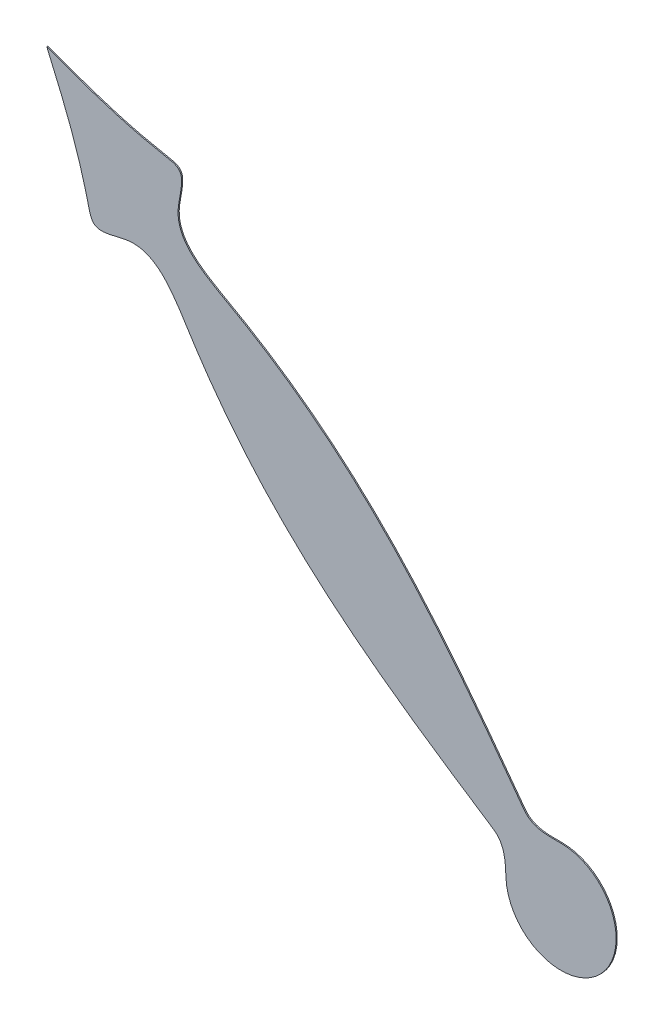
ISO-10303-21;
HEADER;
FILE_DESCRIPTION(('STEP AP214'),'2;1');
FILE_NAME('part.step','',(''),(''),'','','');
FILE_SCHEMA(('AUTOMOTIVE_DESIGN { 1 0 10303 214 1 1 1 1 }'));
ENDSEC;
DATA;
#1=APPLICATION_CONTEXT('core data for automotive mechanical design processes');
#2=APPLICATION_PROTOCOL_DEFINITION('international standard','automotive_design',2000,#1);
#3=PRODUCT_CONTEXT('',#1,'mechanical');
#4=PRODUCT('Part','Part','',(#3));
#5=PRODUCT_RELATED_PRODUCT_CATEGORY('part','',(#4));
#6=PRODUCT_DEFINITION_FORMATION('','',#4);
#7=PRODUCT_DEFINITION_CONTEXT('part definition',#1,'design');
#8=PRODUCT_DEFINITION('design','',#6,#7);
#9=PRODUCT_DEFINITION_SHAPE('','',#8);
#10=(LENGTH_UNIT() NAMED_UNIT(*) SI_UNIT(.MILLI.,.METRE.));
#11=(NAMED_UNIT(*) PLANE_ANGLE_UNIT() SI_UNIT($,.RADIAN.));
#12=(NAMED_UNIT(*) SI_UNIT($,.STERADIAN.) SOLID_ANGLE_UNIT());
#13=UNCERTAINTY_MEASURE_WITH_UNIT(LENGTH_MEASURE(1.E-05),#10,'distance_accuracy_value','');
#14=(GEOMETRIC_REPRESENTATION_CONTEXT(3) GLOBAL_UNCERTAINTY_ASSIGNED_CONTEXT((#13)) GLOBAL_UNIT_ASSIGNED_CONTEXT((#10,
#11,#12)) REPRESENTATION_CONTEXT('',''));
#15=CARTESIAN_POINT('',(0.,0.,0.));
#16=DIRECTION('',(0.,0.,1.));
#17=DIRECTION('',(1.,0.,0.));
#18=AXIS2_PLACEMENT_3D('',#15,#16,#17);
#19=CARTESIAN_POINT('',(-45.7949236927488,-95.5558881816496,-149.9));
#20=CARTESIAN_POINT('',(-44.4225158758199,-98.7122041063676,-149.9));
#21=CARTESIAN_POINT('',(-42.8852946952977,-102.247564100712,-149.9));
#22=CARTESIAN_POINT('',(-41.6323586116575,-107.973642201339,-149.9));
#23=CARTESIAN_POINT('',(-36.4743629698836,-105.480202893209,-149.9));
#24=CARTESIAN_POINT('',(-27.4220206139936,-121.94428006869,-149.9));
#25=CARTESIAN_POINT('',(-15.9034448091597,-129.515818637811,-149.9));
#26=CARTESIAN_POINT('',(-6.27471187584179,-135.845101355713,-149.9));
#27=B_SPLINE_CURVE_WITH_KNOTS('',3,(#19,#20,#21,#22,#23,#24,#25,#26),.UNSPECIFIED.,.F.,.F.,(4,1,
1,1,1,4),(0.,0.18583195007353,0.208148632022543,0.262469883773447,0.383475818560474,1.),.UNSPECIFIED.);
#28=DIRECTION('',(0.,0.,-1.));
#29=VECTOR('',#28,1.);
#30=SURFACE_OF_LINEAR_EXTRUSION('',#27,#29);
#31=CARTESIAN_POINT('',(-45.7949236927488,-95.5558881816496,-150.));
#32=CARTESIAN_POINT('',(-44.4225158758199,-98.7122041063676,-150.));
#33=CARTESIAN_POINT('',(-42.8852946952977,-102.247564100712,-150.));
#34=CARTESIAN_POINT('',(-41.6323586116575,-107.973642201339,-150.));
#35=CARTESIAN_POINT('',(-36.4743629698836,-105.480202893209,-150.));
#36=CARTESIAN_POINT('',(-27.4220206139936,-121.94428006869,-150.));
#37=CARTESIAN_POINT('',(-15.9034448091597,-129.515818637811,-150.));
#38=CARTESIAN_POINT('',(-6.27471187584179,-135.845101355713,-150.));
#39=B_SPLINE_CURVE_WITH_KNOTS('',3,(#31,#32,#33,#34,#35,#36,#37,#38),.UNSPECIFIED.,.F.,.F.,(4,1,
1,1,1,4),(0.,0.18583195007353,0.208148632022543,0.262469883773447,0.383475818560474,1.),.UNSPECIFIED.);
#40=CARTESIAN_POINT('',(-45.7949236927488,-95.5558881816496,-150.));
#41=VERTEX_POINT('',#40);
#42=CARTESIAN_POINT('',(-6.27471187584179,-135.845101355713,-150.));
#43=VERTEX_POINT('',#42);
#44=EDGE_CURVE('E415',#41,#43,#39,.T.);
#45=ORIENTED_EDGE('',*,*,#44,.T.);
#46=DIRECTION('',(0.,0.,-1.));
#47=VECTOR('',#46,1.);
#48=CARTESIAN_POINT('',(-6.27471187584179,-135.845101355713,-149.9));
#49=LINE('',#48,#47);
#50=CARTESIAN_POINT('',(-6.27471187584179,-135.845101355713,-149.9));
#51=VERTEX_POINT('',#50);
#52=EDGE_CURVE('E11',#51,#43,#49,.T.);
#53=ORIENTED_EDGE('',*,*,#52,.F.);
#54=CARTESIAN_POINT('',(-45.7949236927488,-95.5558881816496,-149.9));
#55=VERTEX_POINT('',#54);
#56=EDGE_CURVE('E452',#55,#51,#27,.T.);
#57=ORIENTED_EDGE('',*,*,#56,.F.);
#58=DIRECTION('',(0.,0.,-1.));
#59=VECTOR('',#58,1.);
#60=CARTESIAN_POINT('',(-45.7949236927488,-95.5558881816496,-149.9));
#61=LINE('',#60,#59);
#62=EDGE_CURVE('E428',#55,#41,#61,.T.);
#63=ORIENTED_EDGE('',*,*,#62,.T.);
#64=EDGE_LOOP('',(#45,#53,#57,#63));
#65=FACE_BOUND('',#64,.T.);
#66=ADVANCED_FACE('F364',(#65),#30,.F.);
#67=CARTESIAN_POINT('',(-6.27471187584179,-135.845101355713,-149.9));
#68=CARTESIAN_POINT('',(-6.07860767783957,-135.975969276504,-149.9));
#69=CARTESIAN_POINT('',(-5.00294805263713,-136.693798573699,-149.9));
#70=CARTESIAN_POINT('',(-4.94585231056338,-138.104653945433,-149.9));
#71=CARTESIAN_POINT('',(-4.89916572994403,-139.258295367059,-149.9));
#72=B_SPLINE_CURVE_WITH_KNOTS('',3,(#67,#68,#69,#70,#71),.UNSPECIFIED.,.F.,.F.,(4,1,4),(0.,
0.182310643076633,1.),.UNSPECIFIED.);
#73=DIRECTION('',(0.,0.,-1.));
#74=VECTOR('',#73,1.);
#75=SURFACE_OF_LINEAR_EXTRUSION('',#72,#74);
#76=CARTESIAN_POINT('',(-6.27471187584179,-135.845101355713,-150.));
#77=CARTESIAN_POINT('',(-6.07860767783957,-135.975969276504,-150.));
#78=CARTESIAN_POINT('',(-5.00294805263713,-136.693798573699,-150.));
#79=CARTESIAN_POINT('',(-4.94585231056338,-138.104653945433,-150.));
#80=CARTESIAN_POINT('',(-4.89916572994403,-139.258295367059,-150.));
#81=B_SPLINE_CURVE_WITH_KNOTS('',3,(#76,#77,#78,#79,#80),.UNSPECIFIED.,.F.,.F.,(4,1,4),(0.,
0.182310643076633,1.),.UNSPECIFIED.);
#82=CARTESIAN_POINT('',(-4.89916572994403,-139.258295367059,-150.));
#83=VERTEX_POINT('',#82);
#84=EDGE_CURVE('E411',#43,#83,#81,.T.);
#85=ORIENTED_EDGE('',*,*,#84,.T.);
#86=DIRECTION('',(0.,0.,-1.));
#87=VECTOR('',#86,1.);
#88=CARTESIAN_POINT('',(-4.89916572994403,-139.258295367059,-149.9));
#89=LINE('',#88,#87);
#90=CARTESIAN_POINT('',(-4.89916572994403,-139.258295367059,-149.9));
#91=VERTEX_POINT('',#90);
#92=EDGE_CURVE('E372',#91,#83,#89,.T.);
#93=ORIENTED_EDGE('',*,*,#92,.F.);
#94=EDGE_CURVE('E424',#51,#91,#72,.T.);
#95=ORIENTED_EDGE('',*,*,#94,.F.);
#96=ORIENTED_EDGE('',*,*,#52,.T.);
#97=EDGE_LOOP('',(#85,#93,#95,#96));
#98=FACE_BOUND('',#97,.T.);
#99=ADVANCED_FACE('F423',(#98),#75,.F.);
#100=CARTESIAN_POINT('',(2.55157122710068E-12,-138.999999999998,-149.9));
#101=DIRECTION('',(0.,0.,-1.));
#102=DIRECTION('',(-1.,0.,0.));
#103=AXIS2_PLACEMENT_3D('',#100,#101,#102);
#104=CYLINDRICAL_SURFACE('',#103,4.90596996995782);
#105=CARTESIAN_POINT('',(2.55157122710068E-12,-138.999999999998,-150.));
#106=DIRECTION('',(0.,0.,1.));
#107=DIRECTION('',(1.,0.,0.));
#108=AXIS2_PLACEMENT_3D('',#105,#106,#107);
#109=CIRCLE('',#108,4.90596996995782);
#110=CARTESIAN_POINT('',(2.55157122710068E-12,-134.09403003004,-150.));
#111=VERTEX_POINT('',#110);
#112=EDGE_CURVE('E417',#83,#111,#109,.T.);
#113=ORIENTED_EDGE('',*,*,#112,.T.);
#114=DIRECTION('',(0.,0.,-1.));
#115=VECTOR('',#114,1.);
#116=CARTESIAN_POINT('',(2.55157122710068E-12,-134.09403003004,-149.9));
#117=LINE('',#116,#115);
#118=CARTESIAN_POINT('',(2.55157122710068E-12,-134.09403003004,-149.9));
#119=VERTEX_POINT('',#118);
#120=EDGE_CURVE('E502',#119,#111,#117,.T.);
#121=ORIENTED_EDGE('',*,*,#120,.F.);
#122=CARTESIAN_POINT('',(2.55157122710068E-12,-138.999999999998,-149.9));
#123=DIRECTION('',(0.,0.,1.));
#124=DIRECTION('',(1.,0.,0.));
#125=AXIS2_PLACEMENT_3D('',#122,#123,#124);
#126=CIRCLE('',#125,4.90596996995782);
#127=EDGE_CURVE('E467',#91,#119,#126,.T.);
#128=ORIENTED_EDGE('',*,*,#127,.F.);
#129=ORIENTED_EDGE('',*,*,#92,.T.);
#130=EDGE_LOOP('',(#113,#121,#128,#129));
#131=FACE_BOUND('',#130,.T.);
#132=ADVANCED_FACE('F474',(#131),#104,.T.);
#133=CARTESIAN_POINT('',(2.55157122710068E-12,-134.09403003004,-149.9));
#134=CARTESIAN_POINT('',(-1.15449941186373,-134.108146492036,-149.9));
#135=CARTESIAN_POINT('',(-2.56640406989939,-134.125410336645,-149.9));
#136=CARTESIAN_POINT('',(-3.33987040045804,-133.089035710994,-149.9));
#137=CARTESIAN_POINT('',(-3.48088154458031,-132.900093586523,-149.9));
#138=B_SPLINE_CURVE_WITH_KNOTS('',3,(#133,#134,#135,#136,#137),.UNSPECIFIED.,.F.,.F.,(4,1,4),
(0.,0.817689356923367,1.),.UNSPECIFIED.);
#139=DIRECTION('',(0.,0.,-1.));
#140=VECTOR('',#139,1.);
#141=SURFACE_OF_LINEAR_EXTRUSION('',#138,#140);
#142=CARTESIAN_POINT('',(2.55157122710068E-12,-134.09403003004,-150.));
#143=CARTESIAN_POINT('',(-1.15449941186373,-134.108146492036,-150.));
#144=CARTESIAN_POINT('',(-2.56640406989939,-134.125410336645,-150.));
#145=CARTESIAN_POINT('',(-3.33987040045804,-133.089035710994,-150.));
#146=CARTESIAN_POINT('',(-3.48088154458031,-132.900093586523,-150.));
#147=B_SPLINE_CURVE_WITH_KNOTS('',3,(#142,#143,#144,#145,#146),.UNSPECIFIED.,.F.,.F.,(4,1,4),
(0.,0.817689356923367,1.),.UNSPECIFIED.);
#148=CARTESIAN_POINT('',(-3.48088154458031,-132.900093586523,-150.));
#149=VERTEX_POINT('',#148);
#150=EDGE_CURVE('E442',#111,#149,#147,.T.);
#151=ORIENTED_EDGE('',*,*,#150,.T.);
#152=DIRECTION('',(0.,0.,-1.));
#153=VECTOR('',#152,1.);
#154=CARTESIAN_POINT('',(-3.48088154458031,-132.900093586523,-149.9));
#155=LINE('',#154,#153);
#156=CARTESIAN_POINT('',(-3.48088154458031,-132.900093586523,-149.9));
#157=VERTEX_POINT('',#156);
#158=EDGE_CURVE('E499',#157,#149,#155,.T.);
#159=ORIENTED_EDGE('',*,*,#158,.F.);
#160=EDGE_CURVE('E384',#119,#157,#138,.T.);
#161=ORIENTED_EDGE('',*,*,#160,.F.);
#162=ORIENTED_EDGE('',*,*,#120,.T.);
#163=EDGE_LOOP('',(#151,#159,#161,#162));
#164=FACE_BOUND('',#163,.T.);
#165=ADVANCED_FACE('F477',(#164),#141,.F.);
#166=CARTESIAN_POINT('',(-3.48088154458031,-132.900093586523,-149.9));
#167=CARTESIAN_POINT('',(-10.3083310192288,-123.617946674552,-149.9));
#168=CARTESIAN_POINT('',(-18.4758121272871,-112.513981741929,-149.9));
#169=CARTESIAN_POINT('',(-35.3936533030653,-104.34101475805,-149.9));
#170=CARTESIAN_POINT('',(-33.1752365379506,-99.0588953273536,-149.9));
#171=CARTESIAN_POINT('',(-38.9593390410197,-98.1091703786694,-149.9));
#172=CARTESIAN_POINT('',(-42.5707291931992,-96.7602150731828,-149.9));
#173=CARTESIAN_POINT('',(-45.7949236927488,-95.5558881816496,-149.9));
#174=B_SPLINE_CURVE_WITH_KNOTS('',3,(#166,#167,#168,#169,#170,#171,#172,#173),.UNSPECIFIED.,.F.,
.F.,(4,1,1,1,1,4),(0.,0.616524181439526,0.737530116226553,0.791851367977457,0.814168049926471,
1.),.UNSPECIFIED.);
#175=DIRECTION('',(0.,0.,-1.));
#176=VECTOR('',#175,1.);
#177=SURFACE_OF_LINEAR_EXTRUSION('',#174,#176);
#178=CARTESIAN_POINT('',(-3.48088154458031,-132.900093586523,-150.));
#179=CARTESIAN_POINT('',(-10.3083310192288,-123.617946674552,-150.));
#180=CARTESIAN_POINT('',(-18.4758121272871,-112.513981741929,-150.));
#181=CARTESIAN_POINT('',(-35.3936533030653,-104.34101475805,-150.));
#182=CARTESIAN_POINT('',(-33.1752365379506,-99.0588953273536,-150.));
#183=CARTESIAN_POINT('',(-38.9593390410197,-98.1091703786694,-150.));
#184=CARTESIAN_POINT('',(-42.5707291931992,-96.7602150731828,-150.));
#185=CARTESIAN_POINT('',(-45.7949236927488,-95.5558881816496,-150.));
#186=B_SPLINE_CURVE_WITH_KNOTS('',3,(#178,#179,#180,#181,#182,#183,#184,#185),.UNSPECIFIED.,.F.,
.F.,(4,1,1,1,1,4),(0.,0.616524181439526,0.737530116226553,0.791851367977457,0.814168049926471,
1.),.UNSPECIFIED.);
#187=EDGE_CURVE('E446',#149,#41,#186,.T.);
#188=ORIENTED_EDGE('',*,*,#187,.T.);
#189=ORIENTED_EDGE('',*,*,#62,.F.);
#190=EDGE_CURVE('E379',#157,#55,#174,.T.);
#191=ORIENTED_EDGE('',*,*,#190,.F.);
#192=ORIENTED_EDGE('',*,*,#158,.T.);
#193=EDGE_LOOP('',(#188,#189,#191,#192));
#194=FACE_BOUND('',#193,.T.);
#195=ADVANCED_FACE('F481',(#194),#177,.F.);
#196=CARTESIAN_POINT('',(-28.5506489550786,-117.552411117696,-149.9));
#197=DIRECTION('',(0.,0.,1.));
#198=DIRECTION('',(1.,0.,0.));
#199=AXIS2_PLACEMENT_3D('',#196,#197,#198);
#200=PLANE('',#199);
#201=ORIENTED_EDGE('',*,*,#56,.T.);
#202=ORIENTED_EDGE('',*,*,#94,.T.);
#203=ORIENTED_EDGE('',*,*,#127,.T.);
#204=ORIENTED_EDGE('',*,*,#160,.T.);
#205=ORIENTED_EDGE('',*,*,#190,.T.);
#206=EDGE_LOOP('',(#201,#202,#203,#204,#205));
#207=FACE_BOUND('',#206,.T.);
#208=ADVANCED_FACE('F506',(#207),#200,.T.);
#209=CARTESIAN_POINT('',(-28.5506489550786,-117.552411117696,-150.));
#210=DIRECTION('',(0.,0.,1.));
#211=DIRECTION('',(1.,0.,0.));
#212=AXIS2_PLACEMENT_3D('',#209,#210,#211);
#213=PLANE('',#212);
#214=ORIENTED_EDGE('',*,*,#44,.F.);
#215=ORIENTED_EDGE('',*,*,#187,.F.);
#216=ORIENTED_EDGE('',*,*,#150,.F.);
#217=ORIENTED_EDGE('',*,*,#112,.F.);
#218=ORIENTED_EDGE('',*,*,#84,.F.);
#219=EDGE_LOOP('',(#214,#215,#216,#217,#218));
#220=FACE_BOUND('',#219,.T.);
#221=ADVANCED_FACE('F412',(#220),#213,.F.);
#222=CLOSED_SHELL('',(#66,#99,#132,#165,#195,#208,#221));
#223=MANIFOLD_SOLID_BREP('B2',#222);
#224=ADVANCED_BREP_SHAPE_REPRESENTATION('',(#18,#223),#14);
#225=SHAPE_DEFINITION_REPRESENTATION(#9,#224);
ENDSEC;
END-ISO-10303-21;
